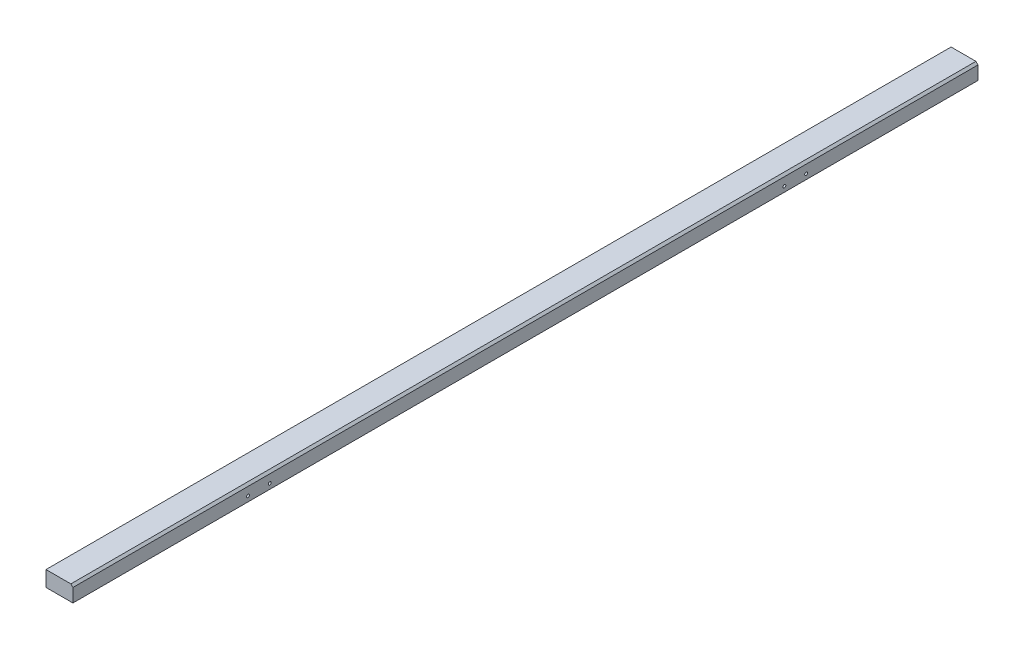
from build123d import *

# Parameters (mm, degrees)
EXTRUSION1_DEPTH = 1748
D_GAGEMENT_M51_D = 5.5


with BuildPart() as part:
    # Esquisse1 → Extrusion1 (new body)
    with BuildSketch(Plane.XY):
        Polygon((48, 30), (52, 26), (52, 0), (0, 0), (0, 30), align=None)
    extrude(amount=EXTRUSION1_DEPTH)

    # D_gagement M51 (through all)
    with Locations(Plane(origin=(52, 0, 0), x_dir=(0, 0, -1), z_dir=(1, 0, 0))):
        with Locations((-1410, 10), (-1368, 10), (-374, 10), (-332, 10)):
            Hole(D_GAGEMENT_M51_D / 2)


solid = part.part
